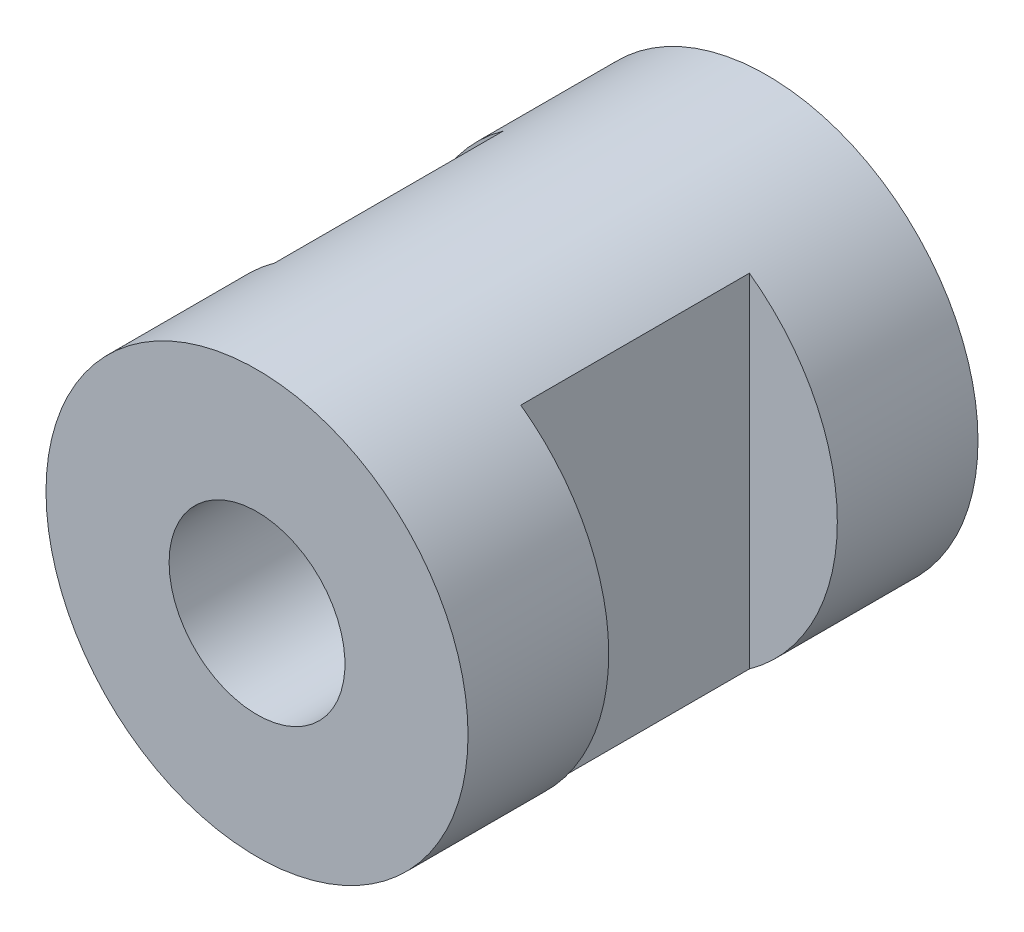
from build123d import *

# Parameters (mm, degrees)
SKETCH_1_R          = 6
EXTRUDE_1_DEPTH     = 14.5
SKETCH_2_W          = 3.256435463
SKETCH_2_H          = 6.5
CUT_EXTRUDE_1_DEPTH = 23.410934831
SKETCH_3_R          = 2.5
CUT_EXTRUDE_2_DEPTH = 14.5


with BuildPart() as part:
    # Sketch 1 → Extrude 1 (new body)
    with BuildSketch(Plane.XY):
        with Locations(Location((0, 0, 0), (0, 0, 180))):
            Circle(SKETCH_1_R)
    extrude(amount=EXTRUDE_1_DEPTH)

    # Sketch 2 → Cut-Extrude 1 (cut, through all)
    with BuildSketch(Plane(origin=(0, 10, 0), x_dir=(-1, 0, 0), z_dir=(0, 1, 0))):
        with Locations((-5.128217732, 7.25)):
            Rectangle(SKETCH_2_W, SKETCH_2_H)
        with Locations((5.128217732, 7.25)):
            Rectangle(SKETCH_2_W, SKETCH_2_H)
    extrude(amount=-CUT_EXTRUDE_1_DEPTH, mode=Mode.SUBTRACT)

    # Sketch 3 → Cut-Extrude 2 (cut)
    with BuildSketch(Plane(origin=(0, 0, 0), x_dir=(-1, 0, 0), z_dir=(0, 0, -1))):
        Circle(SKETCH_3_R)
    extrude(amount=-CUT_EXTRUDE_2_DEPTH, mode=Mode.SUBTRACT)


solid = part.part
